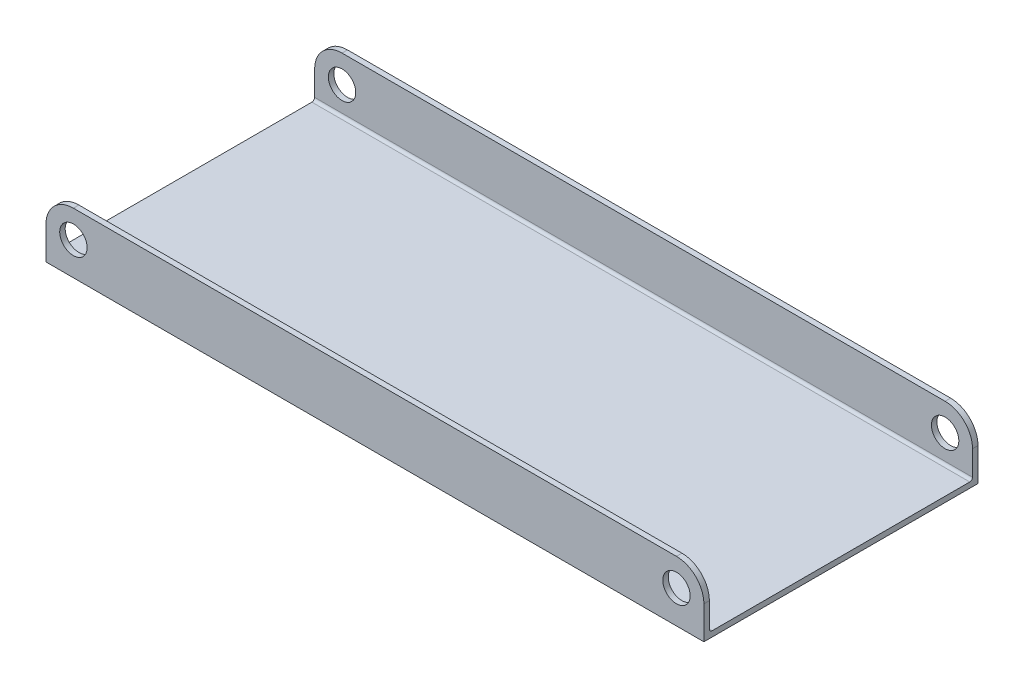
from build123d import *

# Parameters (mm, degrees)
SKETCH1_W           = 152.4
SKETCH1_H           = 1.27
SKETCH1_H_2         = 60.96
BOSS_EXTRUDE1_DEPTH = 1.27
SKETCH1_3_W         = 152.4
SKETCH1_3_H         = 1.27
BOSS_EXTRUDE2_DEPTH = 13.97
CUT_EXTRUDE1_DEPTH  = 166.689984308
SKETCH3_R           = 3.175
CUT_EXTRUDE2_DEPTH  = 166.689984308
FILLET1_R           = 0.635
FILLET2_R           = 0.635


with BuildPart() as part:
    # Sketch1 → Boss-Extrude1 (new body)
    with BuildSketch(Plane(origin=(0, 0, 0), x_dir=(1, 0, 0), z_dir=(0, 1, 0))):
        with Locations((76.2, 62.865)):
            Rectangle(SKETCH1_W, SKETCH1_H)
        with Locations((76.2, 31.75)):
            Rectangle(SKETCH1_W, SKETCH1_H_2)
        with Locations((76.2, 0.635)):
            Rectangle(SKETCH1_W, SKETCH1_H)
    extrude(amount=BOSS_EXTRUDE1_DEPTH)

    # Sketch1_3 → Boss-Extrude2 (add)
    with BuildSketch(Plane(origin=(0, 0, 0), x_dir=(1, 0, 0), z_dir=(0, 1, 0))):
        with Locations((76.2, 0.635)):
            Rectangle(SKETCH1_3_W, SKETCH1_3_H)
        with Locations((76.2, 62.865)):
            Rectangle(SKETCH1_3_W, SKETCH1_3_H)
    extrude(amount=BOSS_EXTRUDE2_DEPTH)

    # Sketch2 → Cut-Extrude1 (cut, through all)
    with BuildSketch(Plane.XY):
        with BuildLine():
            Line((0, 13.97), (0, 7.62))
            ThreePointArc((0, 7.62), (1.859871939, 12.110128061), (6.35, 13.97))
            Line((6.35, 13.97), (0, 13.97))
        make_face()
        with BuildLine():
            ThreePointArc((146.05, 13.97), (150.540128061, 12.110128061), (152.4, 7.62))
            Line((152.4, 7.62), (152.4, 13.97))
            Line((152.4, 13.97), (146.05, 13.97))
        make_face()
    extrude(amount=-CUT_EXTRUDE1_DEPTH, mode=Mode.SUBTRACT)

    # Sketch3 → Cut-Extrude2 (cut, through all)
    with BuildSketch(Plane.XY):
        with Locations((6.35, 7.62)):
            Circle(SKETCH3_R)
        with Locations((146.05, 7.62)):
            Circle(SKETCH3_R)
    extrude(amount=-CUT_EXTRUDE2_DEPTH, mode=Mode.SUBTRACT)

    # Fillet1
    fillet1_edges = [part.edges().sort_by_distance(p)[0] for p in [
        (76.2, 1.27, -62.23),
    ]]
    fillet(fillet1_edges, radius=FILLET1_R)

    # Fillet2
    fillet2_edges = [part.edges().sort_by_distance(p)[0] for p in [
        (76.2, 1.27, -1.27),
    ]]
    fillet(fillet2_edges, radius=FILLET2_R)


solid = part.part
